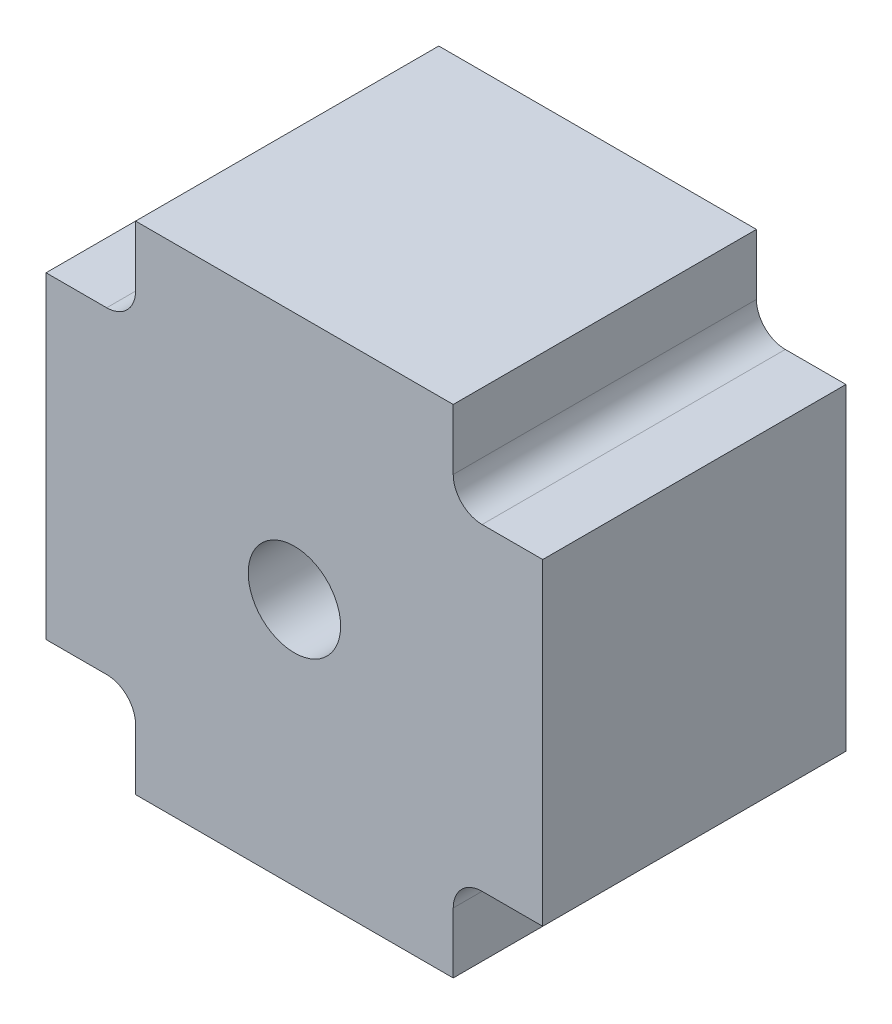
from build123d import *

# Parameters (mm, degrees)
EXTRUDE_1_DEPTH     = 52.5
FILLET_1_R          = 5
FILLET_2_R          = 5
SKETCH_2_R          = 8
CUT_EXTRUDE_1_DEPTH = 57


with BuildPart() as part:
    # Sketch 1 → Extrude 1 (new body)
    with BuildSketch(Plane.XY):
        Polygon((-27.5, 27.5), (-43, 27.5), (-43, -27.5), (-27.5, -27.5), (-27.5, -43), (27.5, -43), (27.5, -27.5), (43, -27.5), (43, 27.5), (27.5, 27.5), (27.5, 43), (-27.5, 43), align=None)
    extrude(amount=EXTRUDE_1_DEPTH)

    # Fillet 1
    fillet_1_edges = [part.edges().sort_by_distance(p)[0] for p in [
        (27.5, 27.5, 26.25),
    ]]
    fillet(fillet_1_edges, radius=FILLET_1_R)

    # Fillet 2
    fillet_2_edges = [part.edges().sort_by_distance(p)[0] for p in [
        (-27.5, 27.5, 26.25),
        (27.5, -27.5, 26.25),
        (-27.5, -27.5, 26.25),
    ]]
    fillet(fillet_2_edges, radius=FILLET_2_R)

    # Sketch 2 → Cut-Extrude 1 (cut)
    with BuildSketch(Plane.XY.offset(52.5)):
        Circle(SKETCH_2_R)
    extrude(amount=-CUT_EXTRUDE_1_DEPTH, mode=Mode.SUBTRACT)


solid = part.part
